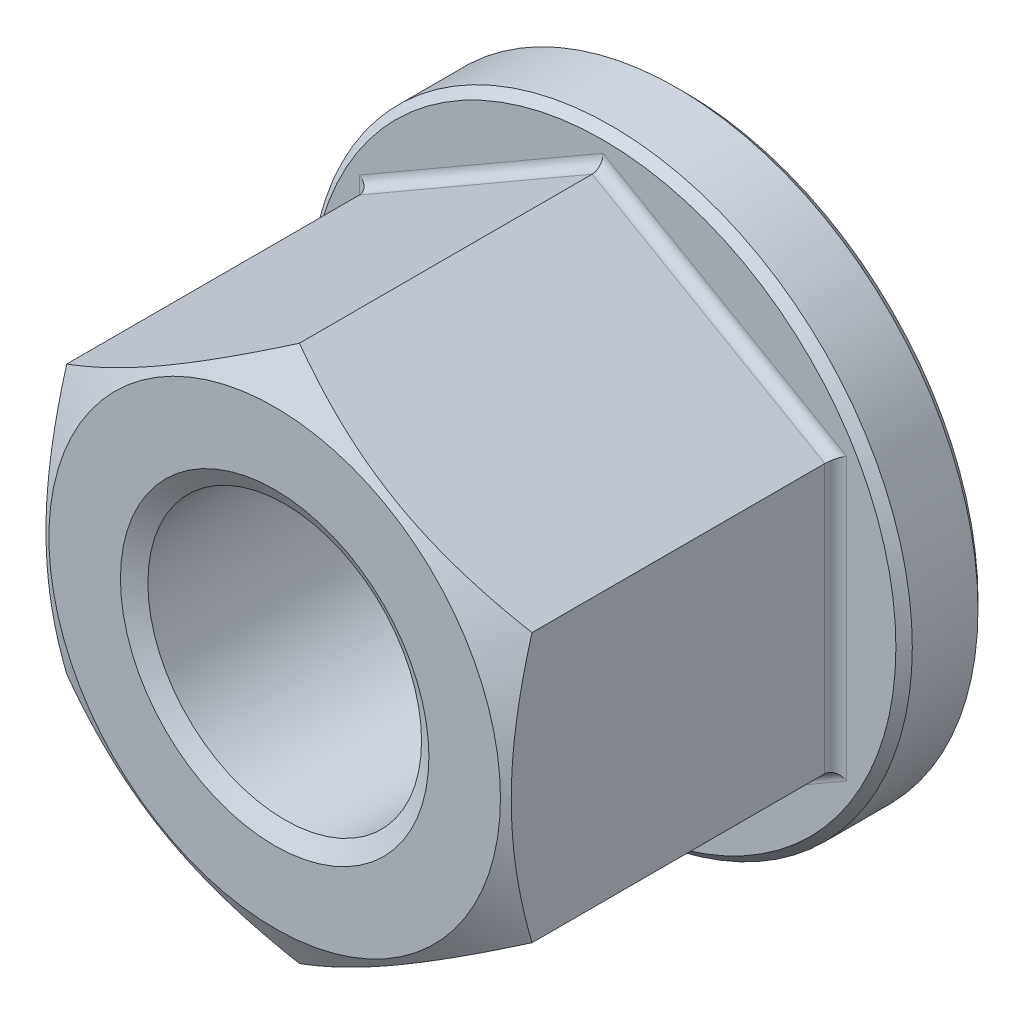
ISO-10303-21;
HEADER;
FILE_DESCRIPTION(('STEP AP214'),'2;1');
FILE_NAME('part.step','',(''),(''),'','','');
FILE_SCHEMA(('AUTOMOTIVE_DESIGN { 1 0 10303 214 1 1 1 1 }'));
ENDSEC;
DATA;
#1=APPLICATION_CONTEXT('core data for automotive mechanical design processes');
#2=APPLICATION_PROTOCOL_DEFINITION('international standard','automotive_design',2000,#1);
#3=PRODUCT_CONTEXT('',#1,'mechanical');
#4=PRODUCT('Part','Part','',(#3));
#5=PRODUCT_RELATED_PRODUCT_CATEGORY('part','',(#4));
#6=PRODUCT_DEFINITION_FORMATION('','',#4);
#7=PRODUCT_DEFINITION_CONTEXT('part definition',#1,'design');
#8=PRODUCT_DEFINITION('design','',#6,#7);
#9=PRODUCT_DEFINITION_SHAPE('','',#8);
#10=(LENGTH_UNIT() NAMED_UNIT(*) SI_UNIT(.MILLI.,.METRE.));
#11=(NAMED_UNIT(*) PLANE_ANGLE_UNIT() SI_UNIT($,.RADIAN.));
#12=(NAMED_UNIT(*) SI_UNIT($,.STERADIAN.) SOLID_ANGLE_UNIT());
#13=UNCERTAINTY_MEASURE_WITH_UNIT(LENGTH_MEASURE(1.E-05),#10,'distance_accuracy_value','');
#14=(GEOMETRIC_REPRESENTATION_CONTEXT(3) GLOBAL_UNCERTAINTY_ASSIGNED_CONTEXT((#13)) GLOBAL_UNIT_ASSIGNED_CONTEXT((#10,
#11,#12)) REPRESENTATION_CONTEXT('',''));
#15=CARTESIAN_POINT('',(0.,0.,0.));
#16=DIRECTION('',(0.,0.,1.));
#17=DIRECTION('',(1.,0.,0.));
#18=AXIS2_PLACEMENT_3D('',#15,#16,#17);
#19=CARTESIAN_POINT('',(-8.5,-4.90747728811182,3.));
#20=DIRECTION('',(-0.5,-0.866025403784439,0.));
#21=DIRECTION('',(0.866025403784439,-0.5,0.));
#22=AXIS2_PLACEMENT_3D('',#19,#20,#21);
#23=PLANE('',#22);
#24=DIRECTION('',(0.,0.,1.));
#25=VECTOR('',#24,1.);
#26=CARTESIAN_POINT('',(-8.5,-4.90747728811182,3.));
#27=LINE('',#26,#25);
#28=CARTESIAN_POINT('',(-8.5,-4.90747728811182,3.4));
#29=VERTEX_POINT('',#28);
#30=CARTESIAN_POINT('',(-8.5,-4.90747728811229,14.0964730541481));
#31=VERTEX_POINT('',#30);
#32=EDGE_CURVE('E166',#29,#31,#27,.T.);
#33=ORIENTED_EDGE('',*,*,#32,.F.);
#34=DIRECTION('',(0.866025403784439,-0.5,0.));
#35=VECTOR('',#34,1.);
#36=CARTESIAN_POINT('',(0.,-9.81495457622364,3.4));
#37=LINE('',#36,#35);
#38=CARTESIAN_POINT('',(0.,-9.81495457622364,3.4));
#39=VERTEX_POINT('',#38);
#40=EDGE_CURVE('E37',#29,#39,#37,.T.);
#41=ORIENTED_EDGE('',*,*,#40,.T.);
#42=DIRECTION('',(0.,0.,1.));
#43=VECTOR('',#42,1.);
#44=CARTESIAN_POINT('',(0.,-9.81495457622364,3.));
#45=LINE('',#44,#43);
#46=CARTESIAN_POINT('',(0.,-9.81495457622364,14.0964730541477));
#47=VERTEX_POINT('',#46);
#48=EDGE_CURVE('E97',#39,#47,#45,.T.);
#49=ORIENTED_EDGE('',*,*,#48,.T.);
#50=CARTESIAN_POINT('',(0.0002,-9.81507004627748,14.0964063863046));
#51=CARTESIAN_POINT('',(-0.18663922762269,-9.70719836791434,14.1586762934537));
#52=CARTESIAN_POINT('',(-0.374175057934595,-9.59892450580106,14.2181201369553));
#53=CARTESIAN_POINT('',(-0.75076975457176,-9.3814974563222,14.3305773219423));
#54=CARTESIAN_POINT('',(-0.939829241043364,-9.27234391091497,14.3835878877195));
#55=CARTESIAN_POINT('',(-1.5100347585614,-8.94313560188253,14.5319290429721));
#56=CARTESIAN_POINT('',(-1.89343164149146,-8.72178130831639,14.6163035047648));
#57=CARTESIAN_POINT('',(-2.46717766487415,-8.39052888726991,14.7152424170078));
#58=CARTESIAN_POINT('',(-2.65581276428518,-8.28162036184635,14.7434272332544));
#59=CARTESIAN_POINT('',(-3.03393602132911,-8.06331079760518,14.7906883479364));
#60=CARTESIAN_POINT('',(-3.22342410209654,-7.95390980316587,14.8097654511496));
#61=CARTESIAN_POINT('',(-3.6027265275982,-7.73491944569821,14.8383276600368));
#62=CARTESIAN_POINT('',(-3.79254025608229,-7.62533043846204,14.8478236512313));
#63=CARTESIAN_POINT('',(-4.17234305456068,-7.40605119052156,14.8570200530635));
#64=CARTESIAN_POINT('',(-4.36233211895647,-7.29636095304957,14.8567207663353));
#65=CARTESIAN_POINT('',(-4.71752301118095,-7.09129139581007,14.8470079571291));
#66=CARTESIAN_POINT('',(-4.8827499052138,-6.99589760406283,14.838779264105));
#67=CARTESIAN_POINT('',(-5.21281671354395,-6.80533344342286,14.8150731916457));
#68=CARTESIAN_POINT('',(-5.37765660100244,-6.71016309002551,14.7995953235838));
#69=CARTESIAN_POINT('',(-5.87153810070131,-6.42502047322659,14.742653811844));
#70=CARTESIAN_POINT('',(-6.19970550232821,-6.23555293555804,14.690689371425));
#71=CARTESIAN_POINT('',(-6.85952142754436,-5.8546080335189,14.5607774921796));
#72=CARTESIAN_POINT('',(-7.19108574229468,-5.66317928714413,14.4822793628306));
#73=CARTESIAN_POINT('',(-7.84926989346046,-5.28317649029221,14.30412109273));
#74=CARTESIAN_POINT('',(-8.17589815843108,-5.09459757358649,14.2045027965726));
#75=CARTESIAN_POINT('',(-8.5002,-4.90736181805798,14.0964063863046));
#76=B_SPLINE_CURVE_WITH_KNOTS('',3,(#50,#51,#52,#53,#54,#55,#56,#57,#58,#59,#60,#61,#62,#63,#64,
#65,#66,#67,#68,#69,#70,#71,#72,#73,#74,#75),.UNSPECIFIED.,.F.,.F.,(4,2,2,2,2,2,2,2,2,2,2,2,4),
(0.,0.673596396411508,1.34748239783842,2.69805431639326,3.356799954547,4.01548737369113,
4.67342558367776,5.33134346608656,5.9040955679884,6.47688628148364,7.62328361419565,
8.79510569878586,9.9646274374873),.UNSPECIFIED.);
#77=EDGE_CURVE('E109',#47,#31,#76,.T.);
#78=ORIENTED_EDGE('',*,*,#77,.T.);
#79=EDGE_LOOP('',(#33,#41,#49,#78));
#80=FACE_BOUND('',#79,.T.);
#81=ADVANCED_FACE('F14',(#80),#23,.T.);
#82=CARTESIAN_POINT('',(-8.5,4.90747728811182,3.));
#83=DIRECTION('',(-1.,0.,0.));
#84=DIRECTION('',(0.,-1.,0.));
#85=AXIS2_PLACEMENT_3D('',#82,#83,#84);
#86=PLANE('',#85);
#87=DIRECTION('',(0.,0.,1.));
#88=VECTOR('',#87,1.);
#89=CARTESIAN_POINT('',(-8.5,4.90747728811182,3.));
#90=LINE('',#89,#88);
#91=CARTESIAN_POINT('',(-8.5,4.90747728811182,3.4));
#92=VERTEX_POINT('',#91);
#93=CARTESIAN_POINT('',(-8.5,4.90747728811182,14.0964730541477));
#94=VERTEX_POINT('',#93);
#95=EDGE_CURVE('E169',#92,#94,#90,.T.);
#96=ORIENTED_EDGE('',*,*,#95,.F.);
#97=DIRECTION('',(0.,-1.,0.));
#98=VECTOR('',#97,1.);
#99=CARTESIAN_POINT('',(-8.5,-4.90747728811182,3.4));
#100=LINE('',#99,#98);
#101=EDGE_CURVE('E30',#92,#29,#100,.T.);
#102=ORIENTED_EDGE('',*,*,#101,.T.);
#103=ORIENTED_EDGE('',*,*,#32,.T.);
#104=CARTESIAN_POINT('',(-8.5,-13.3585541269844,10.6216415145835));
#105=CARTESIAN_POINT('',(-8.5,-12.9857313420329,10.8031965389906));
#106=CARTESIAN_POINT('',(-8.5,-12.6120713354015,10.9830608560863));
#107=CARTESIAN_POINT('',(-8.5,-11.8626321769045,11.3384604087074));
#108=CARTESIAN_POINT('',(-8.5,-11.4868527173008,11.5139949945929));
#109=CARTESIAN_POINT('',(-8.5,-10.7308778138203,11.8606328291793));
#110=CARTESIAN_POINT('',(-8.5,-10.3506695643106,12.031708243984));
#111=CARTESIAN_POINT('',(-8.5,-9.58728957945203,12.3670883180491));
#112=CARTESIAN_POINT('',(-8.5,-9.20411798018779,12.5313932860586));
#113=CARTESIAN_POINT('',(-8.5,-8.42128837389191,12.8568185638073));
#114=CARTESIAN_POINT('',(-8.5,-8.02150846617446,13.0176472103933));
#115=CARTESIAN_POINT('',(-8.5,-7.21733840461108,13.3275542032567));
#116=CARTESIAN_POINT('',(-8.5,-6.81294774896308,13.476631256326));
#117=CARTESIAN_POINT('',(-8.5,-5.9996088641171,13.7592507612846));
#118=CARTESIAN_POINT('',(-8.5,-5.59067115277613,13.892823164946));
#119=CARTESIAN_POINT('',(-8.5,-4.7669470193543,14.1402662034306));
#120=CARTESIAN_POINT('',(-8.5,-4.35216242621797,14.2541428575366));
#121=CARTESIAN_POINT('',(-8.5,-3.51871930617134,14.4562413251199));
#122=CARTESIAN_POINT('',(-8.5,-3.10009615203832,14.5446051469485));
#123=CARTESIAN_POINT('',(-8.5,-2.46821264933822,14.6542699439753));
#124=CARTESIAN_POINT('',(-8.5,-2.25691283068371,14.6870127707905));
#125=CARTESIAN_POINT('',(-8.5,-1.83320401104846,14.7442339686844));
#126=CARTESIAN_POINT('',(-8.5,-1.62079511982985,14.7687131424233));
#127=CARTESIAN_POINT('',(-8.5,-1.19800548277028,14.808602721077));
#128=CARTESIAN_POINT('',(-8.5,-0.98763587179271,14.8241306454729));
#129=CARTESIAN_POINT('',(-8.5,-0.566427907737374,14.8462687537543));
#130=CARTESIAN_POINT('',(-8.5,-0.355589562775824,14.8528790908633));
#131=CARTESIAN_POINT('',(-8.5,0.0661797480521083,14.8570235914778));
#132=CARTESIAN_POINT('',(-8.5,0.277110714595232,14.8545576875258));
#133=CARTESIAN_POINT('',(-8.5,0.698676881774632,14.8406119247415));
#134=CARTESIAN_POINT('',(-8.5,0.909312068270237,14.8291316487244));
#135=CARTESIAN_POINT('',(-8.5,1.41017977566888,14.7913622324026));
#136=CARTESIAN_POINT('',(-8.5,1.70011906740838,14.7610941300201));
#137=CARTESIAN_POINT('',(-8.5,2.27794732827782,14.685089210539));
#138=CARTESIAN_POINT('',(-8.5,2.56583603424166,14.6393504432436));
#139=CARTESIAN_POINT('',(-8.5,3.42603051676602,14.481345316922));
#140=CARTESIAN_POINT('',(-8.5,3.9945783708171,14.348314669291));
#141=CARTESIAN_POINT('',(-8.5,4.8451577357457,14.116281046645));
#142=CARTESIAN_POINT('',(-8.5,5.13156112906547,14.0323715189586));
#143=CARTESIAN_POINT('',(-8.5,5.70158876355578,13.8555068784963));
#144=CARTESIAN_POINT('',(-8.5,5.98521298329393,13.7625516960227));
#145=CARTESIAN_POINT('',(-8.5,6.54976880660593,13.5691146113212));
#146=CARTESIAN_POINT('',(-8.5,6.83070115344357,13.4686348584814));
#147=CARTESIAN_POINT('',(-8.5,7.39021279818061,13.2613639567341));
#148=CARTESIAN_POINT('',(-8.5,7.66879215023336,13.1545729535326));
#149=CARTESIAN_POINT('',(-8.5,8.42086818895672,12.8580568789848));
#150=CARTESIAN_POINT('',(-8.5,8.8923663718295,12.6632675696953));
#151=CARTESIAN_POINT('',(-8.5,9.83049674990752,12.262262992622));
#152=CARTESIAN_POINT('',(-8.5,10.2971283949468,12.0560464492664));
#153=CARTESIAN_POINT('',(-8.5,11.226648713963,11.6349034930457));
#154=CARTESIAN_POINT('',(-8.5,11.6895358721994,11.4199737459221));
#155=CARTESIAN_POINT('',(-8.5,12.6121458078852,10.9834970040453));
#156=CARTESIAN_POINT('',(-8.5,13.0718687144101,10.761950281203));
#157=CARTESIAN_POINT('',(-8.5,13.9895195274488,10.3133243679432));
#158=CARTESIAN_POINT('',(-8.5,14.4474433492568,10.0862368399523));
#159=CARTESIAN_POINT('',(-8.5,15.361230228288,9.62795016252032));
#160=CARTESIAN_POINT('',(-8.5,15.8170932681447,9.39675097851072));
#161=CARTESIAN_POINT('',(-8.5,16.7270264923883,8.93110296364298));
#162=CARTESIAN_POINT('',(-8.5,17.1810970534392,8.69665486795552));
#163=CARTESIAN_POINT('',(-8.5,18.0878397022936,8.22506824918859));
#164=CARTESIAN_POINT('',(-8.5,18.5405117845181,7.98792971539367));
#165=CARTESIAN_POINT('',(-8.5,19.8006565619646,7.32386607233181));
#166=CARTESIAN_POINT('',(-8.5,20.6068546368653,6.89452270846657));
#167=CARTESIAN_POINT('',(-8.5,22.2165644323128,6.03072153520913));
#168=CARTESIAN_POINT('',(-8.5,23.0200759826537,5.59626340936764));
#169=CARTESIAN_POINT('',(-8.5,24.6223324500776,4.72499888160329));
#170=CARTESIAN_POINT('',(-8.5,25.4210843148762,4.28820524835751));
#171=CARTESIAN_POINT('',(-8.5,26.6179828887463,3.63085355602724));
#172=CARTESIAN_POINT('',(-8.5,27.0167286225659,3.41138475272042));
#173=CARTESIAN_POINT('',(-8.5,27.8138635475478,2.9718017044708));
#174=CARTESIAN_POINT('',(-8.5,28.2122527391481,2.75168746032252));
#175=CARTESIAN_POINT('',(-8.5,28.6104855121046,2.53129051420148));
#176=B_SPLINE_CURVE_WITH_KNOTS('',3,(#104,#105,#106,#107,#108,#109,#110,#111,#112,#113,#114,
#115,#116,#117,#118,#119,#120,#121,#122,#123,#124,#125,#126,#127,#128,#129,#130,#131,#132,#133,
#134,#135,#136,#137,#138,#139,#140,#141,#142,#143,#144,#145,#146,#147,#148,#149,#150,#151,#152,
#153,#154,#155,#156,#157,#158,#159,#160,#161,#162,#163,#164,#165,#166,#167,#168,#169,#170,#171,
#172,#173,#174,#175),.UNSPECIFIED.,.F.,.F.,(4,2,2,2,2,2,2,2,2,2,2,2,2,2,2,2,2,2,2,2,2,2,2,2,2,2,
2,2,2,2,2,2,2,2,2,4),(0.,1.244052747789,2.48829103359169,3.73900820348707,4.98966827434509,
6.28227705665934,7.57502788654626,8.8652382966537,10.1550537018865,11.4375449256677,
12.0788738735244,12.7201405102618,13.3527841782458,13.9854169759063,14.618054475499,
15.2507212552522,16.1247760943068,16.9989411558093,18.7481293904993,19.6433760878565,
20.5386296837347,21.4336285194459,22.3286067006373,23.8588318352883,25.389228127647,
26.9202156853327,28.4511404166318,29.9845313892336,31.5179352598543,33.050997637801,
34.5840661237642,37.3242234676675,40.0645512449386,42.7956852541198,44.1611453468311,
45.526603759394),.UNSPECIFIED.);
#177=EDGE_CURVE('E161',#31,#94,#176,.T.);
#178=ORIENTED_EDGE('',*,*,#177,.T.);
#179=EDGE_LOOP('',(#96,#102,#103,#178));
#180=FACE_BOUND('',#179,.T.);
#181=ADVANCED_FACE('F151',(#180),#86,.T.);
#182=CARTESIAN_POINT('',(0.,9.81495457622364,3.));
#183=DIRECTION('',(-0.5,0.866025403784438,0.));
#184=DIRECTION('',(-0.866025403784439,-0.5,0.));
#185=AXIS2_PLACEMENT_3D('',#182,#183,#184);
#186=PLANE('',#185);
#187=DIRECTION('',(0.,0.,1.));
#188=VECTOR('',#187,1.);
#189=CARTESIAN_POINT('',(0.,9.81495457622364,3.));
#190=LINE('',#189,#188);
#191=CARTESIAN_POINT('',(0.,9.81495457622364,3.4));
#192=VERTEX_POINT('',#191);
#193=CARTESIAN_POINT('',(0.,9.81495457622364,14.0964730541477));
#194=VERTEX_POINT('',#193);
#195=EDGE_CURVE('E171',#192,#194,#190,.T.);
#196=ORIENTED_EDGE('',*,*,#195,.F.);
#197=DIRECTION('',(-0.866025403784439,-0.5,0.));
#198=VECTOR('',#197,1.);
#199=CARTESIAN_POINT('',(-8.5,4.90747728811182,3.4));
#200=LINE('',#199,#198);
#201=EDGE_CURVE('E186',#192,#92,#200,.T.);
#202=ORIENTED_EDGE('',*,*,#201,.T.);
#203=ORIENTED_EDGE('',*,*,#95,.T.);
#204=CARTESIAN_POINT('',(-8.5002,4.90736181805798,14.0964063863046));
#205=CARTESIAN_POINT('',(-8.31336077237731,5.01523349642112,14.1586762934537));
#206=CARTESIAN_POINT('',(-8.1258249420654,5.1235073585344,14.2181201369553));
#207=CARTESIAN_POINT('',(-7.74923024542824,5.34093440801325,14.3305773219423));
#208=CARTESIAN_POINT('',(-7.56017075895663,5.45008795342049,14.3835878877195));
#209=CARTESIAN_POINT('',(-6.9899652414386,5.77929626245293,14.5319290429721));
#210=CARTESIAN_POINT('',(-6.60656835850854,6.00065055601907,14.6163035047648));
#211=CARTESIAN_POINT('',(-6.03282233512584,6.33190297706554,14.7152424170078));
#212=CARTESIAN_POINT('',(-5.84418723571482,6.44081150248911,14.7434272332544));
#213=CARTESIAN_POINT('',(-5.46606397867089,6.65912106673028,14.7906883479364));
#214=CARTESIAN_POINT('',(-5.27657589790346,6.76852206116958,14.8097654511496));
#215=CARTESIAN_POINT('',(-4.8972734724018,6.98751241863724,14.8383276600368));
#216=CARTESIAN_POINT('',(-4.70745974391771,7.09710142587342,14.8478236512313));
#217=CARTESIAN_POINT('',(-4.32765694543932,7.31638067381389,14.8570200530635));
#218=CARTESIAN_POINT('',(-4.13766788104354,7.42607091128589,14.8567207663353));
#219=CARTESIAN_POINT('',(-3.78247698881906,7.63114046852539,14.8470079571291));
#220=CARTESIAN_POINT('',(-3.6172500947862,7.72653426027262,14.838779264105));
#221=CARTESIAN_POINT('',(-3.28718328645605,7.9170984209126,14.8150731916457));
#222=CARTESIAN_POINT('',(-3.12234339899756,8.01226877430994,14.7995953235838));
#223=CARTESIAN_POINT('',(-2.62846189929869,8.29741139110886,14.742653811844));
#224=CARTESIAN_POINT('',(-2.30029449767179,8.48687892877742,14.690689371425));
#225=CARTESIAN_POINT('',(-1.64047857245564,8.86782383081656,14.5607774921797));
#226=CARTESIAN_POINT('',(-1.30891425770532,9.05925257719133,14.4822793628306));
#227=CARTESIAN_POINT('',(-0.650730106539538,9.43925537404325,14.30412109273));
#228=CARTESIAN_POINT('',(-0.324101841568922,9.62783429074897,14.2045027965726));
#229=CARTESIAN_POINT('',(0.000199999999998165,9.81507004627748,14.0964063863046));
#230=B_SPLINE_CURVE_WITH_KNOTS('',3,(#204,#205,#206,#207,#208,#209,#210,#211,#212,#213,#214,
#215,#216,#217,#218,#219,#220,#221,#222,#223,#224,#225,#226,#227,#228,#229),.UNSPECIFIED.,.F.,
.F.,(4,2,2,2,2,2,2,2,2,2,2,2,4),(0.,0.673596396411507,1.34748239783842,2.69805431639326,
3.356799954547,4.01548737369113,4.67342558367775,5.33134346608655,5.90409556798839,
6.47688628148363,7.62328361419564,8.79510569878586,9.9646274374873),.UNSPECIFIED.);
#231=EDGE_CURVE('E116',#94,#194,#230,.T.);
#232=ORIENTED_EDGE('',*,*,#231,.T.);
#233=EDGE_LOOP('',(#196,#202,#203,#232));
#234=FACE_BOUND('',#233,.T.);
#235=ADVANCED_FACE('F304',(#234),#186,.T.);
#236=CARTESIAN_POINT('',(8.5,4.90747728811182,3.));
#237=DIRECTION('',(0.5,0.866025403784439,0.));
#238=DIRECTION('',(-0.866025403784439,0.5,0.));
#239=AXIS2_PLACEMENT_3D('',#236,#237,#238);
#240=PLANE('',#239);
#241=DIRECTION('',(0.,0.,1.));
#242=VECTOR('',#241,1.);
#243=CARTESIAN_POINT('',(8.5,4.90747728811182,3.));
#244=LINE('',#243,#242);
#245=CARTESIAN_POINT('',(8.5,4.90747728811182,3.4));
#246=VERTEX_POINT('',#245);
#247=CARTESIAN_POINT('',(8.5,4.90747728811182,14.0964730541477));
#248=VERTEX_POINT('',#247);
#249=EDGE_CURVE('E96',#246,#248,#244,.T.);
#250=ORIENTED_EDGE('',*,*,#249,.F.);
#251=DIRECTION('',(-0.866025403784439,0.5,0.));
#252=VECTOR('',#251,1.);
#253=CARTESIAN_POINT('',(0.,9.81495457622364,3.4));
#254=LINE('',#253,#252);
#255=EDGE_CURVE('E202',#246,#192,#254,.T.);
#256=ORIENTED_EDGE('',*,*,#255,.T.);
#257=ORIENTED_EDGE('',*,*,#195,.T.);
#258=CARTESIAN_POINT('',(-0.000200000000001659,9.81507004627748,14.0964063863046));
#259=CARTESIAN_POINT('',(0.186639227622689,9.70719836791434,14.1586762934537));
#260=CARTESIAN_POINT('',(0.374175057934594,9.59892450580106,14.2181201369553));
#261=CARTESIAN_POINT('',(0.75076975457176,9.3814974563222,14.3305773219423));
#262=CARTESIAN_POINT('',(0.939829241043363,9.27234391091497,14.3835878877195));
#263=CARTESIAN_POINT('',(1.51003475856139,8.94313560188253,14.5319290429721));
#264=CARTESIAN_POINT('',(1.89343164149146,8.72178130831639,14.6163035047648));
#265=CARTESIAN_POINT('',(2.46717766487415,8.39052888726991,14.7152424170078));
#266=CARTESIAN_POINT('',(2.65581276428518,8.28162036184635,14.7434272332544));
#267=CARTESIAN_POINT('',(3.03393602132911,8.06331079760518,14.7906883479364));
#268=CARTESIAN_POINT('',(3.22342410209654,7.95390980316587,14.8097654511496));
#269=CARTESIAN_POINT('',(3.6027265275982,7.73491944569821,14.8383276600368));
#270=CARTESIAN_POINT('',(3.79254025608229,7.62533043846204,14.8478236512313));
#271=CARTESIAN_POINT('',(4.17234305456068,7.40605119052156,14.8570200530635));
#272=CARTESIAN_POINT('',(4.36233211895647,7.29636095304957,14.8567207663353));
#273=CARTESIAN_POINT('',(4.71752301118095,7.09129139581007,14.8470079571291));
#274=CARTESIAN_POINT('',(4.8827499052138,6.99589760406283,14.838779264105));
#275=CARTESIAN_POINT('',(5.21281671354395,6.80533344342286,14.8150731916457));
#276=CARTESIAN_POINT('',(5.37765660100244,6.71016309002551,14.7995953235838));
#277=CARTESIAN_POINT('',(5.87153810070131,6.42502047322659,14.742653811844));
#278=CARTESIAN_POINT('',(6.19970550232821,6.23555293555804,14.690689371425));
#279=CARTESIAN_POINT('',(6.85952142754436,5.8546080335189,14.5607774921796));
#280=CARTESIAN_POINT('',(7.19108574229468,5.66317928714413,14.4822793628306));
#281=CARTESIAN_POINT('',(7.84926989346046,5.28317649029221,14.30412109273));
#282=CARTESIAN_POINT('',(8.17589815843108,5.09459757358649,14.2045027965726));
#283=CARTESIAN_POINT('',(8.5002,4.90736181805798,14.0964063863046));
#284=B_SPLINE_CURVE_WITH_KNOTS('',3,(#258,#259,#260,#261,#262,#263,#264,#265,#266,#267,#268,
#269,#270,#271,#272,#273,#274,#275,#276,#277,#278,#279,#280,#281,#282,#283),.UNSPECIFIED.,.F.,
.F.,(4,2,2,2,2,2,2,2,2,2,2,2,4),(0.,0.673596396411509,1.34748239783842,2.69805431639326,
3.356799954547,4.01548737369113,4.67342558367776,5.33134346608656,5.9040955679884,
6.47688628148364,7.62328361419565,8.79510569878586,9.96462743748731),.UNSPECIFIED.);
#285=EDGE_CURVE('E114',#194,#248,#284,.T.);
#286=ORIENTED_EDGE('',*,*,#285,.T.);
#287=EDGE_LOOP('',(#250,#256,#257,#286));
#288=FACE_BOUND('',#287,.T.);
#289=ADVANCED_FACE('F141',(#288),#240,.T.);
#290=CARTESIAN_POINT('',(8.5,-4.90747728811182,3.));
#291=DIRECTION('',(1.,0.,0.));
#292=DIRECTION('',(0.,1.,0.));
#293=AXIS2_PLACEMENT_3D('',#290,#291,#292);
#294=PLANE('',#293);
#295=DIRECTION('',(0.,0.,1.));
#296=VECTOR('',#295,1.);
#297=CARTESIAN_POINT('',(8.5,-4.90747728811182,3.));
#298=LINE('',#297,#296);
#299=CARTESIAN_POINT('',(8.5,-4.90747728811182,3.4));
#300=VERTEX_POINT('',#299);
#301=CARTESIAN_POINT('',(8.5,-4.90747728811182,14.0964730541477));
#302=VERTEX_POINT('',#301);
#303=EDGE_CURVE('E87',#300,#302,#298,.T.);
#304=ORIENTED_EDGE('',*,*,#303,.F.);
#305=DIRECTION('',(0.,1.,0.));
#306=VECTOR('',#305,1.);
#307=CARTESIAN_POINT('',(8.5,4.90747728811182,3.4));
#308=LINE('',#307,#306);
#309=EDGE_CURVE('E204',#300,#246,#308,.T.);
#310=ORIENTED_EDGE('',*,*,#309,.T.);
#311=ORIENTED_EDGE('',*,*,#249,.T.);
#312=CARTESIAN_POINT('',(8.5,-13.3585541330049,10.6216415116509));
#313=CARTESIAN_POINT('',(8.5,-12.9857313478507,10.8031965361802));
#314=CARTESIAN_POINT('',(8.5,-12.6120713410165,10.9830608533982));
#315=CARTESIAN_POINT('',(8.5,-11.8626321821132,11.3384604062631));
#316=CARTESIAN_POINT('',(8.5,-11.486852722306,11.5139949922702));
#317=CARTESIAN_POINT('',(8.5,-10.7308778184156,11.8606328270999));
#318=CARTESIAN_POINT('',(8.5,-10.3506695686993,12.0317082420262));
#319=CARTESIAN_POINT('',(8.5,-9.58728958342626,12.3670883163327));
#320=CARTESIAN_POINT('',(8.5,-9.20411798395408,12.5313932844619));
#321=CARTESIAN_POINT('',(8.5,-8.42128837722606,12.8568185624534));
#322=CARTESIAN_POINT('',(8.5,-8.02150846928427,13.0176472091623));
#323=CARTESIAN_POINT('',(8.5,-7.21733840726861,13.3275542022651));
#324=CARTESIAN_POINT('',(8.5,-6.81294775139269,13.4766312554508));
#325=CARTESIAN_POINT('',(8.5,-5.99960886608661,13.7592507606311));
#326=CARTESIAN_POINT('',(8.5,-5.5906711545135,13.8928231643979));
#327=CARTESIAN_POINT('',(8.5,-4.76694702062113,14.1402662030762));
#328=CARTESIAN_POINT('',(8.5,-4.3521624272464,14.2541428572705));
#329=CARTESIAN_POINT('',(8.5,-3.51871930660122,14.4562413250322));
#330=CARTESIAN_POINT('',(8.5,-3.10009615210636,14.5446051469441));
#331=CARTESIAN_POINT('',(8.5,-2.46821264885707,14.6542699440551));
#332=CARTESIAN_POINT('',(8.5,-2.25691283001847,14.6870127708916));
#333=CARTESIAN_POINT('',(8.5,-1.83320401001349,14.7442339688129));
#334=CARTESIAN_POINT('',(8.5,-1.62079511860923,14.768713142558));
#335=CARTESIAN_POINT('',(8.5,-1.19800548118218,14.8086027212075));
#336=CARTESIAN_POINT('',(8.5,-0.987635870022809,14.8241306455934));
#337=CARTESIAN_POINT('',(8.5,-0.566427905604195,14.8462687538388));
#338=CARTESIAN_POINT('',(8.5,-0.355589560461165,14.8528790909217));
#339=CARTESIAN_POINT('',(8.5,0.0661797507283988,14.8570235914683));
#340=CARTESIAN_POINT('',(8.5,0.277110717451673,14.8545576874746));
#341=CARTESIAN_POINT('',(8.5,0.698676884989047,14.8406119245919));
#342=CARTESIAN_POINT('',(8.5,0.909312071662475,14.8291316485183));
#343=CARTESIAN_POINT('',(8.5,1.41017977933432,14.7913622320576));
#344=CARTESIAN_POINT('',(8.5,1.70011907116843,14.7610941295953));
#345=CARTESIAN_POINT('',(8.5,2.27794733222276,14.6850892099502));
#346=CARTESIAN_POINT('',(8.5,2.56583603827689,14.6393504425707));
#347=CARTESIAN_POINT('',(8.5,3.42603052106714,14.4813453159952));
#348=CARTESIAN_POINT('',(8.5,3.99457837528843,14.3483146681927));
#349=CARTESIAN_POINT('',(8.5,4.84515774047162,14.1162810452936));
#350=CARTESIAN_POINT('',(8.5,5.13156113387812,14.0323715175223));
#351=CARTESIAN_POINT('',(8.5,5.70158876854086,13.8555068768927));
#352=CARTESIAN_POINT('',(8.5,5.98521298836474,13.7625516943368));
#353=CARTESIAN_POINT('',(8.5,6.54976881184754,13.5691146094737));
#354=CARTESIAN_POINT('',(8.5,6.83070115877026,13.4686348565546));
#355=CARTESIAN_POINT('',(8.5,7.39021280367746,13.2613639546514));
#356=CARTESIAN_POINT('',(8.5,7.6687921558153,13.1545729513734));
#357=CARTESIAN_POINT('',(8.5,8.42086819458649,12.8580568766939));
#358=CARTESIAN_POINT('',(8.5,8.89236637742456,12.6632675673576));
#359=CARTESIAN_POINT('',(8.49999999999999,9.83049675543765,12.2622629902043));
#360=CARTESIAN_POINT('',(8.49999999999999,10.2971284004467,12.0560464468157));
#361=CARTESIAN_POINT('',(8.49999999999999,11.2266487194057,11.6349034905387));
#362=CARTESIAN_POINT('',(8.49999999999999,11.6895358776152,11.4199737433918));
#363=CARTESIAN_POINT('',(8.49999999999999,12.6121458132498,10.9834970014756));
#364=CARTESIAN_POINT('',(8.49999999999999,13.0718687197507,10.761950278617));
#365=CARTESIAN_POINT('',(8.49999999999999,13.9895195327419,10.3133243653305));
#366=CARTESIAN_POINT('',(8.49999999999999,14.4474433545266,10.0862368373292));
#367=CARTESIAN_POINT('',(8.49999999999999,15.3612302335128,9.62795015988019));
#368=CARTESIAN_POINT('',(8.49999999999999,15.8170932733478,9.39675097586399));
#369=CARTESIAN_POINT('',(8.49999999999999,16.7270264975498,8.93110296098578));
#370=CARTESIAN_POINT('',(8.49999999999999,17.1810970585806,8.69665486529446));
#371=CARTESIAN_POINT('',(8.49999999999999,18.087839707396,8.225068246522));
#372=CARTESIAN_POINT('',(8.49999999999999,18.5405117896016,7.9879297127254));
#373=CARTESIAN_POINT('',(8.49999999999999,19.8006565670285,7.32386606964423));
#374=CARTESIAN_POINT('',(8.49999999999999,20.6068546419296,6.89452270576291));
#375=CARTESIAN_POINT('',(8.49999999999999,22.2165644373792,6.03072153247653));
#376=CARTESIAN_POINT('',(8.49999999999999,23.0200759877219,5.59626340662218));
#377=CARTESIAN_POINT('',(8.49999999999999,24.6223324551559,4.72499887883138));
#378=CARTESIAN_POINT('',(8.49999999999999,25.4210843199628,4.28820524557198));
#379=CARTESIAN_POINT('',(8.49999999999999,26.6179828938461,3.63085355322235));
#380=CARTESIAN_POINT('',(8.49999999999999,27.0167286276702,3.41138474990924));
#381=CARTESIAN_POINT('',(8.49999999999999,27.8138635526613,2.97180170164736));
#382=CARTESIAN_POINT('',(8.49999999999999,28.2122527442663,2.7516874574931));
#383=CARTESIAN_POINT('',(8.5,28.6104855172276,2.53129051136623));
#384=B_SPLINE_CURVE_WITH_KNOTS('',3,(#312,#313,#314,#315,#316,#317,#318,#319,#320,#321,#322,
#323,#324,#325,#326,#327,#328,#329,#330,#331,#332,#333,#334,#335,#336,#337,#338,#339,#340,#341,
#342,#343,#344,#345,#346,#347,#348,#349,#350,#351,#352,#353,#354,#355,#356,#357,#358,#359,#360,
#361,#362,#363,#364,#365,#366,#367,#368,#369,#370,#371,#372,#373,#374,#375,#376,#377,#378,#379,
#380,#381,#382,#383),.UNSPECIFIED.,.F.,.F.,(4,2,2,2,2,2,2,2,2,2,2,2,2,2,2,2,2,2,2,2,2,2,2,2,2,2,
2,2,2,2,2,2,2,2,2,4),(0.,1.24405274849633,2.48829103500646,3.73900820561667,4.98966827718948,
6.2822770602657,7.57502789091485,8.86523830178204,10.155053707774,11.4375449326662,
12.078873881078,12.7201405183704,13.3527841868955,13.9854169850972,14.6180544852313,
15.250721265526,16.1247761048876,16.9989411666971,18.7481294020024,19.643376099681,
20.5386296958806,21.4336285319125,22.3286067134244,23.8588318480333,25.3892281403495,
26.9202156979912,28.4511404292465,29.9845314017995,31.5179352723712,33.0509976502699,
34.584066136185,37.3242234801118,40.064551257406,42.7956852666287,44.1611453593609,
45.5266037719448),.UNSPECIFIED.);
#385=EDGE_CURVE('E105',#248,#302,#384,.F.);
#386=ORIENTED_EDGE('',*,*,#385,.T.);
#387=EDGE_LOOP('',(#304,#310,#311,#386));
#388=FACE_BOUND('',#387,.T.);
#389=ADVANCED_FACE('F112',(#388),#294,.T.);
#390=CARTESIAN_POINT('',(0.,-9.81495457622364,3.));
#391=DIRECTION('',(0.5,-0.866025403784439,0.));
#392=DIRECTION('',(0.866025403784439,0.5,0.));
#393=AXIS2_PLACEMENT_3D('',#390,#391,#392);
#394=PLANE('',#393);
#395=ORIENTED_EDGE('',*,*,#48,.F.);
#396=DIRECTION('',(0.866025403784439,0.5,0.));
#397=VECTOR('',#396,1.);
#398=CARTESIAN_POINT('',(8.5,-4.90747728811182,3.4));
#399=LINE('',#398,#397);
#400=EDGE_CURVE('E92',#39,#300,#399,.T.);
#401=ORIENTED_EDGE('',*,*,#400,.T.);
#402=ORIENTED_EDGE('',*,*,#303,.T.);
#403=CARTESIAN_POINT('',(8.5002,-4.90736181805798,14.0964063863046));
#404=CARTESIAN_POINT('',(8.31336077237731,-5.01523349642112,14.1586762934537));
#405=CARTESIAN_POINT('',(8.1258249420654,-5.1235073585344,14.2181201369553));
#406=CARTESIAN_POINT('',(7.74923024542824,-5.34093440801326,14.3305773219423));
#407=CARTESIAN_POINT('',(7.56017075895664,-5.45008795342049,14.3835878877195));
#408=CARTESIAN_POINT('',(6.9899652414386,-5.77929626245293,14.5319290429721));
#409=CARTESIAN_POINT('',(6.60656835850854,-6.00065055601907,14.6163035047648));
#410=CARTESIAN_POINT('',(6.03282233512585,-6.33190297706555,14.7152424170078));
#411=CARTESIAN_POINT('',(5.84418723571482,-6.44081150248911,14.7434272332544));
#412=CARTESIAN_POINT('',(5.4660639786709,-6.65912106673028,14.7906883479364));
#413=CARTESIAN_POINT('',(5.27657589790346,-6.76852206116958,14.8097654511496));
#414=CARTESIAN_POINT('',(4.8972734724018,-6.98751241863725,14.8383276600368));
#415=CARTESIAN_POINT('',(4.70745974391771,-7.09710142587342,14.8478236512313));
#416=CARTESIAN_POINT('',(4.32765694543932,-7.31638067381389,14.8570200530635));
#417=CARTESIAN_POINT('',(4.13766788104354,-7.42607091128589,14.8567207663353));
#418=CARTESIAN_POINT('',(3.78247698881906,-7.63114046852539,14.8470079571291));
#419=CARTESIAN_POINT('',(3.6172500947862,-7.72653426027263,14.838779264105));
#420=CARTESIAN_POINT('',(3.28718328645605,-7.9170984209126,14.8150731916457));
#421=CARTESIAN_POINT('',(3.12234339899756,-8.01226877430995,14.7995953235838));
#422=CARTESIAN_POINT('',(2.62846189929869,-8.29741139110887,14.742653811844));
#423=CARTESIAN_POINT('',(2.30029449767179,-8.48687892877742,14.690689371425));
#424=CARTESIAN_POINT('',(1.64047857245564,-8.86782383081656,14.5607774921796));
#425=CARTESIAN_POINT('',(1.30891425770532,-9.05925257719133,14.4822793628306));
#426=CARTESIAN_POINT('',(0.650730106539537,-9.43925537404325,14.30412109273));
#427=CARTESIAN_POINT('',(0.32410184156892,-9.62783429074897,14.2045027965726));
#428=CARTESIAN_POINT('',(-0.000199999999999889,-9.81507004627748,14.0964063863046));
#429=B_SPLINE_CURVE_WITH_KNOTS('',3,(#403,#404,#405,#406,#407,#408,#409,#410,#411,#412,#413,
#414,#415,#416,#417,#418,#419,#420,#421,#422,#423,#424,#425,#426,#427,#428),.UNSPECIFIED.,.F.,
.F.,(4,2,2,2,2,2,2,2,2,2,2,2,4),(0.,0.673596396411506,1.34748239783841,2.69805431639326,
3.35679995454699,4.01548737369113,4.67342558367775,5.33134346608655,5.9040955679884,
6.47688628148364,7.62328361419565,8.79510569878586,9.9646274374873),.UNSPECIFIED.);
#430=EDGE_CURVE('E90',#302,#47,#429,.T.);
#431=ORIENTED_EDGE('',*,*,#430,.T.);
#432=EDGE_LOOP('',(#395,#401,#402,#431));
#433=FACE_BOUND('',#432,.T.);
#434=ADVANCED_FACE('F89',(#433),#394,.T.);
#435=CARTESIAN_POINT('',(0.,0.,15.));
#436=DIRECTION('',(0.,0.,-1.));
#437=DIRECTION('',(-1.,0.,0.));
#438=AXIS2_PLACEMENT_3D('',#435,#436,#437);
#439=CYLINDRICAL_SURFACE('',#438,11.);
#440=CARTESIAN_POINT('',(0.,0.,0.3));
#441=DIRECTION('',(0.,0.,1.));
#442=DIRECTION('',(1.,0.,0.));
#443=AXIS2_PLACEMENT_3D('',#440,#441,#442);
#444=CIRCLE('',#443,11.);
#445=CARTESIAN_POINT('',(11.,0.,0.3));
#446=VERTEX_POINT('',#445);
#447=EDGE_CURVE('E177',#446,#446,#444,.T.);
#448=ORIENTED_EDGE('',*,*,#447,.T.);
#449=EDGE_LOOP('',(#448));
#450=FACE_BOUND('',#449,.T.);
#451=CARTESIAN_POINT('',(0.,0.,2.7));
#452=DIRECTION('',(0.,0.,1.));
#453=DIRECTION('',(1.,0.,0.));
#454=AXIS2_PLACEMENT_3D('',#451,#452,#453);
#455=CIRCLE('',#454,11.);
#456=CARTESIAN_POINT('',(11.,0.,2.7));
#457=VERTEX_POINT('',#456);
#458=EDGE_CURVE('E168',#457,#457,#455,.F.);
#459=ORIENTED_EDGE('',*,*,#458,.T.);
#460=EDGE_LOOP('',(#459));
#461=FACE_BOUND('',#460,.T.);
#462=ADVANCED_FACE('F147',(#450,#461),#439,.T.);
#463=CARTESIAN_POINT('',(0.,0.,0.));
#464=DIRECTION('',(0.,0.,1.));
#465=DIRECTION('',(1.,0.,0.));
#466=AXIS2_PLACEMENT_3D('',#463,#464,#465);
#467=PLANE('',#466);
#468=CARTESIAN_POINT('',(0.,0.,0.));
#469=DIRECTION('',(0.,0.,1.));
#470=DIRECTION('',(1.,0.,0.));
#471=AXIS2_PLACEMENT_3D('',#468,#469,#470);
#472=CIRCLE('',#471,5.6356406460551);
#473=CARTESIAN_POINT('',(5.6356406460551,0.,0.));
#474=VERTEX_POINT('',#473);
#475=EDGE_CURVE('E9',#474,#474,#472,.T.);
#476=ORIENTED_EDGE('',*,*,#475,.T.);
#477=EDGE_LOOP('',(#476));
#478=FACE_BOUND('',#477,.T.);
#479=CARTESIAN_POINT('',(0.,0.,0.));
#480=DIRECTION('',(0.,0.,1.));
#481=DIRECTION('',(1.,0.,0.));
#482=AXIS2_PLACEMENT_3D('',#479,#480,#481);
#483=CIRCLE('',#482,10.7);
#484=CARTESIAN_POINT('',(10.7,0.,0.));
#485=VERTEX_POINT('',#484);
#486=EDGE_CURVE('E180',#485,#485,#483,.F.);
#487=ORIENTED_EDGE('',*,*,#486,.T.);
#488=EDGE_LOOP('',(#487));
#489=FACE_BOUND('',#488,.T.);
#490=ADVANCED_FACE('F277',(#478,#489),#467,.F.);
#491=CARTESIAN_POINT('',(0.,0.,3.));
#492=DIRECTION('',(0.,0.,1.));
#493=DIRECTION('',(1.,0.,0.));
#494=AXIS2_PLACEMENT_3D('',#491,#492,#493);
#495=PLANE('',#494);
#496=DIRECTION('',(0.,-1.,0.));
#497=VECTOR('',#496,1.);
#498=CARTESIAN_POINT('',(-8.9,4.90747728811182,3.));
#499=LINE('',#498,#497);
#500=CARTESIAN_POINT('',(-8.9,-5.13841739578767,3.));
#501=VERTEX_POINT('',#500);
#502=CARTESIAN_POINT('',(-8.9,5.13841739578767,3.));
#503=VERTEX_POINT('',#502);
#504=EDGE_CURVE('E189',#501,#503,#499,.F.);
#505=ORIENTED_EDGE('',*,*,#504,.T.);
#506=DIRECTION('',(-0.866025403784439,-0.5,0.));
#507=VECTOR('',#506,1.);
#508=CARTESIAN_POINT('',(-0.2,10.1613647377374,3.));
#509=LINE('',#508,#507);
#510=CARTESIAN_POINT('',(0.,10.2768347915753,3.));
#511=VERTEX_POINT('',#510);
#512=EDGE_CURVE('E199',#503,#511,#509,.F.);
#513=ORIENTED_EDGE('',*,*,#512,.T.);
#514=DIRECTION('',(-0.866025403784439,0.5,0.));
#515=VECTOR('',#514,1.);
#516=CARTESIAN_POINT('',(8.7,5.2538874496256,3.));
#517=LINE('',#516,#515);
#518=CARTESIAN_POINT('',(8.9,5.13841739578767,3.));
#519=VERTEX_POINT('',#518);
#520=EDGE_CURVE('E197',#511,#519,#517,.F.);
#521=ORIENTED_EDGE('',*,*,#520,.T.);
#522=DIRECTION('',(0.,1.,0.));
#523=VECTOR('',#522,1.);
#524=CARTESIAN_POINT('',(8.9,-4.90747728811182,3.));
#525=LINE('',#524,#523);
#526=CARTESIAN_POINT('',(8.9,-5.13841739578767,3.));
#527=VERTEX_POINT('',#526);
#528=EDGE_CURVE('E195',#519,#527,#525,.F.);
#529=ORIENTED_EDGE('',*,*,#528,.T.);
#530=DIRECTION('',(0.866025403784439,0.5,0.));
#531=VECTOR('',#530,1.);
#532=CARTESIAN_POINT('',(0.2,-10.1613647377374,3.));
#533=LINE('',#532,#531);
#534=CARTESIAN_POINT('',(0.,-10.2768347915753,3.));
#535=VERTEX_POINT('',#534);
#536=EDGE_CURVE('E193',#527,#535,#533,.F.);
#537=ORIENTED_EDGE('',*,*,#536,.T.);
#538=DIRECTION('',(0.866025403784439,-0.5,0.));
#539=VECTOR('',#538,1.);
#540=CARTESIAN_POINT('',(-8.7,-5.2538874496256,3.));
#541=LINE('',#540,#539);
#542=EDGE_CURVE('E191',#535,#501,#541,.F.);
#543=ORIENTED_EDGE('',*,*,#542,.T.);
#544=EDGE_LOOP('',(#505,#513,#521,#529,#537,#543));
#545=FACE_BOUND('',#544,.T.);
#546=CARTESIAN_POINT('',(0.,0.,3.));
#547=DIRECTION('',(0.,0.,1.));
#548=DIRECTION('',(1.,0.,0.));
#549=AXIS2_PLACEMENT_3D('',#546,#547,#548);
#550=CIRCLE('',#549,10.7);
#551=CARTESIAN_POINT('',(10.7,0.,3.));
#552=VERTEX_POINT('',#551);
#553=EDGE_CURVE('E183',#552,#552,#550,.T.);
#554=ORIENTED_EDGE('',*,*,#553,.T.);
#555=EDGE_LOOP('',(#554));
#556=FACE_BOUND('',#555,.T.);
#557=ADVANCED_FACE('F152',(#545,#556),#495,.T.);
#558=CARTESIAN_POINT('',(0.,0.,15.));
#559=DIRECTION('',(0.,0.,-1.));
#560=DIRECTION('',(1.,0.,0.));
#561=AXIS2_PLACEMENT_3D('',#558,#559,#560);
#562=CONICAL_SURFACE('',#561,8.25,1.0471975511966);
#563=ORIENTED_EDGE('',*,*,#430,.F.);
#564=ORIENTED_EDGE('',*,*,#385,.F.);
#565=ORIENTED_EDGE('',*,*,#285,.F.);
#566=ORIENTED_EDGE('',*,*,#231,.F.);
#567=ORIENTED_EDGE('',*,*,#177,.F.);
#568=ORIENTED_EDGE('',*,*,#77,.F.);
#569=EDGE_LOOP('',(#563,#564,#565,#566,#567,#568));
#570=FACE_BOUND('',#569,.T.);
#571=CARTESIAN_POINT('',(0.,0.,15.));
#572=DIRECTION('',(0.,0.,1.));
#573=DIRECTION('',(1.,0.,0.));
#574=AXIS2_PLACEMENT_3D('',#571,#572,#573);
#575=CIRCLE('',#574,8.25);
#576=CARTESIAN_POINT('',(8.25,0.,15.));
#577=VERTEX_POINT('',#576);
#578=EDGE_CURVE('E110',#577,#577,#575,.T.);
#579=ORIENTED_EDGE('',*,*,#578,.F.);
#580=EDGE_LOOP('',(#579));
#581=FACE_BOUND('',#580,.T.);
#582=ADVANCED_FACE('F102',(#570,#581),#562,.T.);
#583=CARTESIAN_POINT('',(0.,0.,15.));
#584=DIRECTION('',(0.,0.,1.));
#585=DIRECTION('',(1.,0.,0.));
#586=AXIS2_PLACEMENT_3D('',#583,#584,#585);
#587=PLANE('',#586);
#588=CARTESIAN_POINT('',(0.,0.,15.));
#589=DIRECTION('',(0.,0.,1.));
#590=DIRECTION('',(1.,0.,0.));
#591=AXIS2_PLACEMENT_3D('',#588,#589,#590);
#592=CIRCLE('',#591,5.63564064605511);
#593=CARTESIAN_POINT('',(5.63564064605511,0.,15.));
#594=VERTEX_POINT('',#593);
#595=EDGE_CURVE('E23',#594,#594,#592,.F.);
#596=ORIENTED_EDGE('',*,*,#595,.T.);
#597=EDGE_LOOP('',(#596));
#598=FACE_BOUND('',#597,.T.);
#599=ORIENTED_EDGE('',*,*,#578,.T.);
#600=EDGE_LOOP('',(#599));
#601=FACE_BOUND('',#600,.T.);
#602=ADVANCED_FACE('F229',(#598,#601),#587,.T.);
#603=CARTESIAN_POINT('',(0.,0.,0.3));
#604=DIRECTION('',(0.,0.,1.));
#605=DIRECTION('',(1.,0.,0.));
#606=AXIS2_PLACEMENT_3D('',#603,#604,#605);
#607=CONICAL_SURFACE('',#606,11.,0.785398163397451);
#608=ORIENTED_EDGE('',*,*,#486,.F.);
#609=EDGE_LOOP('',(#608));
#610=FACE_BOUND('',#609,.T.);
#611=ORIENTED_EDGE('',*,*,#447,.F.);
#612=EDGE_LOOP('',(#611));
#613=FACE_BOUND('',#612,.T.);
#614=ADVANCED_FACE('F270',(#610,#613),#607,.T.);
#615=CARTESIAN_POINT('',(0.,0.,3.));
#616=DIRECTION('',(0.,0.,-1.));
#617=DIRECTION('',(-1.,0.,0.));
#618=AXIS2_PLACEMENT_3D('',#615,#616,#617);
#619=CONICAL_SURFACE('',#618,10.7,0.785398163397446);
#620=ORIENTED_EDGE('',*,*,#458,.F.);
#621=EDGE_LOOP('',(#620));
#622=FACE_BOUND('',#621,.T.);
#623=ORIENTED_EDGE('',*,*,#553,.F.);
#624=EDGE_LOOP('',(#623));
#625=FACE_BOUND('',#624,.T.);
#626=ADVANCED_FACE('F252',(#622,#625),#619,.T.);
#627=CARTESIAN_POINT('',(0.2,-10.1613647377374,3.4));
#628=DIRECTION('',(-0.866025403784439,-0.5,0.));
#629=DIRECTION('',(0.5,-0.866025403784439,0.));
#630=AXIS2_PLACEMENT_3D('',#627,#628,#629);
#631=CYLINDRICAL_SURFACE('',#630,0.4);
#632=CARTESIAN_POINT('',(0.,-10.2768347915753,3.4));
#633=DIRECTION('',(-1.,0.,0.));
#634=DIRECTION('',(0.,1.,0.));
#635=AXIS2_PLACEMENT_3D('',#632,#633,#634);
#636=ELLIPSE('',#635,0.461880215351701,0.4);
#637=EDGE_CURVE('E220',#535,#39,#636,.F.);
#638=ORIENTED_EDGE('',*,*,#637,.F.);
#639=ORIENTED_EDGE('',*,*,#536,.F.);
#640=CARTESIAN_POINT('',(8.9,-5.13841739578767,3.4));
#641=DIRECTION('',(-0.5,-0.866025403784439,0.));
#642=DIRECTION('',(-0.866025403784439,0.5,0.));
#643=AXIS2_PLACEMENT_3D('',#640,#641,#642);
#644=ELLIPSE('',#643,0.461880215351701,0.4);
#645=EDGE_CURVE('E223',#300,#527,#644,.T.);
#646=ORIENTED_EDGE('',*,*,#645,.F.);
#647=ORIENTED_EDGE('',*,*,#400,.F.);
#648=EDGE_LOOP('',(#638,#639,#646,#647));
#649=FACE_BOUND('',#648,.T.);
#650=ADVANCED_FACE('F248',(#649),#631,.F.);
#651=CARTESIAN_POINT('',(8.9,-4.90747728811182,3.4));
#652=DIRECTION('',(0.,-1.,0.));
#653=DIRECTION('',(1.,0.,0.));
#654=AXIS2_PLACEMENT_3D('',#651,#652,#653);
#655=CYLINDRICAL_SURFACE('',#654,0.4);
#656=ORIENTED_EDGE('',*,*,#645,.T.);
#657=ORIENTED_EDGE('',*,*,#528,.F.);
#658=CARTESIAN_POINT('',(8.9,5.13841739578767,3.4));
#659=DIRECTION('',(0.5,-0.866025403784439,0.));
#660=DIRECTION('',(-0.866025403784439,-0.5,0.));
#661=AXIS2_PLACEMENT_3D('',#658,#659,#660);
#662=ELLIPSE('',#661,0.461880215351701,0.4);
#663=EDGE_CURVE('E217',#246,#519,#662,.T.);
#664=ORIENTED_EDGE('',*,*,#663,.F.);
#665=ORIENTED_EDGE('',*,*,#309,.F.);
#666=EDGE_LOOP('',(#656,#657,#664,#665));
#667=FACE_BOUND('',#666,.T.);
#668=ADVANCED_FACE('F251',(#667),#655,.F.);
#669=CARTESIAN_POINT('',(-8.7,-5.2538874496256,3.4));
#670=DIRECTION('',(-0.866025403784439,0.5,0.));
#671=DIRECTION('',(-0.5,-0.866025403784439,0.));
#672=AXIS2_PLACEMENT_3D('',#669,#670,#671);
#673=CYLINDRICAL_SURFACE('',#672,0.4);
#674=ORIENTED_EDGE('',*,*,#637,.T.);
#675=ORIENTED_EDGE('',*,*,#40,.F.);
#676=CARTESIAN_POINT('',(-8.9,-5.13841739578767,3.4));
#677=DIRECTION('',(-0.5,0.866025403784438,0.));
#678=DIRECTION('',(0.866025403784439,0.5,0.));
#679=AXIS2_PLACEMENT_3D('',#676,#677,#678);
#680=ELLIPSE('',#679,0.461880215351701,0.4);
#681=EDGE_CURVE('E214',#501,#29,#680,.F.);
#682=ORIENTED_EDGE('',*,*,#681,.F.);
#683=ORIENTED_EDGE('',*,*,#542,.F.);
#684=EDGE_LOOP('',(#674,#675,#682,#683));
#685=FACE_BOUND('',#684,.T.);
#686=ADVANCED_FACE('F256',(#685),#673,.F.);
#687=CARTESIAN_POINT('',(8.7,5.2538874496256,3.4));
#688=DIRECTION('',(0.866025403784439,-0.5,0.));
#689=DIRECTION('',(0.5,0.866025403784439,0.));
#690=AXIS2_PLACEMENT_3D('',#687,#688,#689);
#691=CYLINDRICAL_SURFACE('',#690,0.4);
#692=ORIENTED_EDGE('',*,*,#663,.T.);
#693=ORIENTED_EDGE('',*,*,#520,.F.);
#694=CARTESIAN_POINT('',(0.,10.2768347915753,3.4));
#695=DIRECTION('',(1.,0.,0.));
#696=DIRECTION('',(0.,-1.,0.));
#697=AXIS2_PLACEMENT_3D('',#694,#695,#696);
#698=ELLIPSE('',#697,0.461880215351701,0.4);
#699=EDGE_CURVE('E211',#192,#511,#698,.T.);
#700=ORIENTED_EDGE('',*,*,#699,.F.);
#701=ORIENTED_EDGE('',*,*,#255,.F.);
#702=EDGE_LOOP('',(#692,#693,#700,#701));
#703=FACE_BOUND('',#702,.T.);
#704=ADVANCED_FACE('F260',(#703),#691,.F.);
#705=CARTESIAN_POINT('',(-8.9,4.90747728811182,3.4));
#706=DIRECTION('',(0.,1.,0.));
#707=DIRECTION('',(-1.,0.,0.));
#708=AXIS2_PLACEMENT_3D('',#705,#706,#707);
#709=CYLINDRICAL_SURFACE('',#708,0.4);
#710=ORIENTED_EDGE('',*,*,#681,.T.);
#711=ORIENTED_EDGE('',*,*,#101,.F.);
#712=CARTESIAN_POINT('',(-8.9,5.13841739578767,3.4));
#713=DIRECTION('',(0.5,0.866025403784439,0.));
#714=DIRECTION('',(-0.866025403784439,0.5,0.));
#715=AXIS2_PLACEMENT_3D('',#712,#713,#714);
#716=ELLIPSE('',#715,0.461880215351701,0.4);
#717=EDGE_CURVE('E209',#503,#92,#716,.F.);
#718=ORIENTED_EDGE('',*,*,#717,.F.);
#719=ORIENTED_EDGE('',*,*,#504,.F.);
#720=EDGE_LOOP('',(#710,#711,#718,#719));
#721=FACE_BOUND('',#720,.T.);
#722=ADVANCED_FACE('F243',(#721),#709,.F.);
#723=CARTESIAN_POINT('',(-0.2,10.1613647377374,3.4));
#724=DIRECTION('',(0.866025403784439,0.5,0.));
#725=DIRECTION('',(-0.5,0.866025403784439,0.));
#726=AXIS2_PLACEMENT_3D('',#723,#724,#725);
#727=CYLINDRICAL_SURFACE('',#726,0.4);
#728=ORIENTED_EDGE('',*,*,#699,.T.);
#729=ORIENTED_EDGE('',*,*,#512,.F.);
#730=ORIENTED_EDGE('',*,*,#717,.T.);
#731=ORIENTED_EDGE('',*,*,#201,.F.);
#732=EDGE_LOOP('',(#728,#729,#730,#731));
#733=FACE_BOUND('',#732,.T.);
#734=ADVANCED_FACE('F234',(#733),#727,.F.);
#735=CARTESIAN_POINT('',(0.,0.,14.2));
#736=DIRECTION('',(0.,0.,1.));
#737=DIRECTION('',(1.,0.,0.));
#738=AXIS2_PLACEMENT_3D('',#735,#736,#737);
#739=CONICAL_SURFACE('',#738,4.25,1.0471975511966);
#740=CARTESIAN_POINT('',(0.,0.,14.6330127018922));
#741=DIRECTION('',(0.,0.,1.));
#742=DIRECTION('',(1.,0.,0.));
#743=AXIS2_PLACEMENT_3D('',#740,#741,#742);
#744=CIRCLE('',#743,5.);
#745=CARTESIAN_POINT('',(5.,0.,14.6330127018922));
#746=VERTEX_POINT('',#745);
#747=EDGE_CURVE('E212',#746,#746,#744,.T.);
#748=ORIENTED_EDGE('',*,*,#747,.F.);
#749=EDGE_LOOP('',(#748));
#750=FACE_BOUND('',#749,.T.);
#751=ORIENTED_EDGE('',*,*,#595,.F.);
#752=EDGE_LOOP('',(#751));
#753=FACE_BOUND('',#752,.T.);
#754=ADVANCED_FACE('F232',(#750,#753),#739,.F.);
#755=CARTESIAN_POINT('',(0.,0.,0.));
#756=DIRECTION('',(0.,0.,-1.));
#757=DIRECTION('',(-1.,0.,0.));
#758=AXIS2_PLACEMENT_3D('',#755,#756,#757);
#759=CONICAL_SURFACE('',#758,5.6356406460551,1.0471975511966);
#760=CARTESIAN_POINT('',(0.,0.,0.36698729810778));
#761=DIRECTION('',(0.,0.,-1.));
#762=DIRECTION('',(-1.,0.,0.));
#763=AXIS2_PLACEMENT_3D('',#760,#761,#762);
#764=CIRCLE('',#763,5.);
#765=CARTESIAN_POINT('',(-5.,0.,0.36698729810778));
#766=VERTEX_POINT('',#765);
#767=EDGE_CURVE('E18',#766,#766,#764,.T.);
#768=ORIENTED_EDGE('',*,*,#767,.F.);
#769=EDGE_LOOP('',(#768));
#770=FACE_BOUND('',#769,.T.);
#771=ORIENTED_EDGE('',*,*,#475,.F.);
#772=EDGE_LOOP('',(#771));
#773=FACE_BOUND('',#772,.T.);
#774=ADVANCED_FACE('F16',(#770,#773),#759,.F.);
#775=CARTESIAN_POINT('',(0.,0.,0.));
#776=DIRECTION('',(0.,0.,1.));
#777=DIRECTION('',(1.,0.,0.));
#778=AXIS2_PLACEMENT_3D('',#775,#776,#777);
#779=CYLINDRICAL_SURFACE('',#778,5.);
#780=ORIENTED_EDGE('',*,*,#747,.T.);
#781=EDGE_LOOP('',(#780));
#782=FACE_BOUND('',#781,.T.);
#783=ORIENTED_EDGE('',*,*,#767,.T.);
#784=EDGE_LOOP('',(#783));
#785=FACE_BOUND('',#784,.T.);
#786=ADVANCED_FACE('F241',(#782,#785),#779,.F.);
#787=CLOSED_SHELL('',(#81,#181,#235,#289,#389,#434,#462,#490,#557,#582,#602,#614,#626,#650,#668,
#686,#704,#722,#734,#754,#774,#786));
#788=MANIFOLD_SOLID_BREP('B1',#787);
#789=ADVANCED_BREP_SHAPE_REPRESENTATION('',(#18,#788),#14);
#790=SHAPE_DEFINITION_REPRESENTATION(#9,#789);
ENDSEC;
END-ISO-10303-21;
